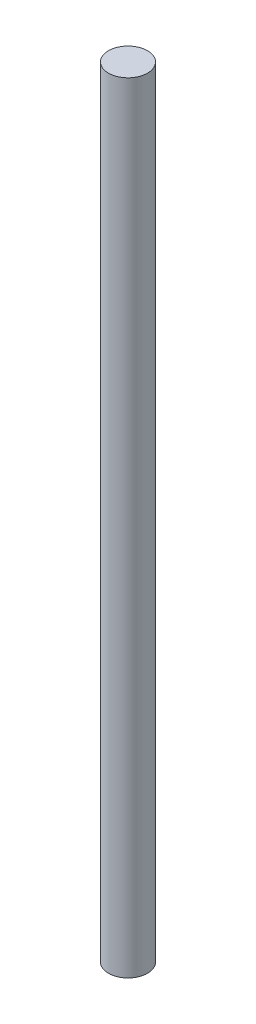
from build123d import *

# Parameters (mm, degrees)
SKETCH1_R           = 12.7
BOSS_EXTRUDE1_DEPTH = 508


with BuildPart() as part:
    # Sketch1 → Boss-Extrude1 (new body)
    with BuildSketch(Plane(origin=(0, 0, 0), x_dir=(1, 0, 0), z_dir=(0, 1, 0))):
        with Locations(Location((0, 0, 0), (0, 0, 270))):
            Circle(SKETCH1_R)
    extrude(amount=-BOSS_EXTRUDE1_DEPTH)


solid = part.part
